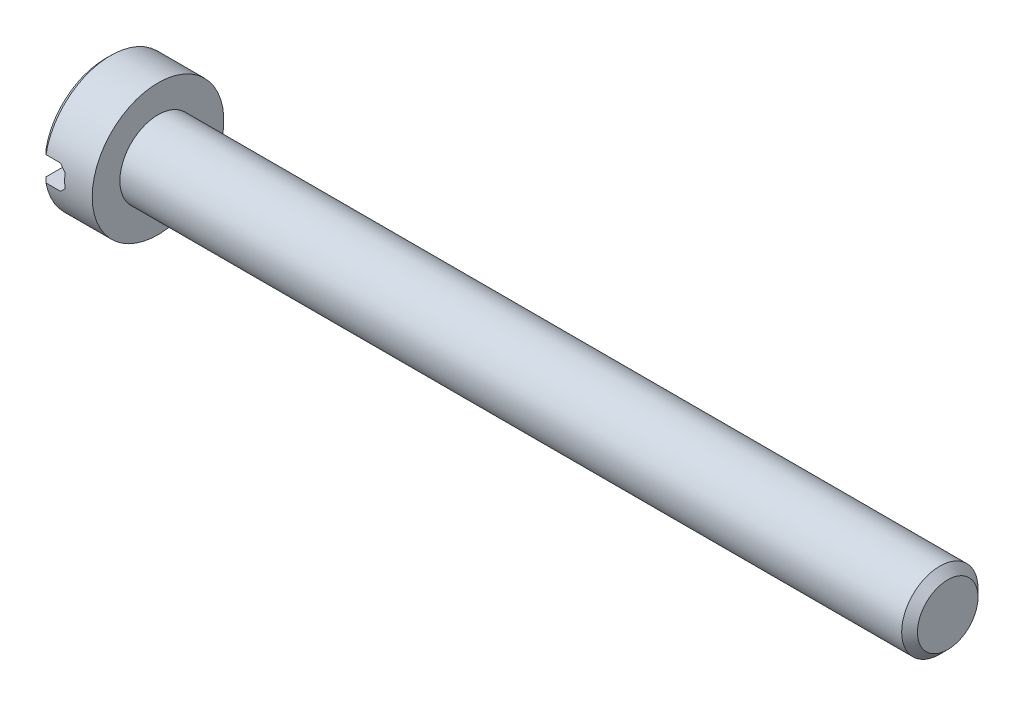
from build123d import *

# Parameters (mm, degrees)
ENL_V_MAT_EXTRU_1_DEPTH = 5
ESQUISSE3_R             = 1.45
EXTRUSION1_DEPTH        = 30
CHANFREIN1_SIZE         = 0.3


with BuildPart() as part:
    # Esquisse1 → R_volution1 (revolve)
    with BuildSketch(Plane.XY, mode=Mode.PRIVATE) as r_volution1_sk:
        Polygon((0, 0), (0, 2.3), (0.2, 2.5), (2, 2.5), (2, 0), align=None)
    revolve(r_volution1_sk.sketch.rotate(Axis((0, 0, 0), (1, 0, 0)), 90), axis=Axis((0, 0, 0), (1, 0, 0)))

    # Esquisse2 → Enl_v. mat.-Extru.1 (cut, symmetric)
    with BuildSketch(Plane.XY):
        Polygon((0, 0.465549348), (0.753445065, 0.465549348), (0.953445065, 0.265549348), (0.953445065, -0.265549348), (0.753445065, -0.465549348), (0, -0.465549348), align=None)
    extrude(amount=ENL_V_MAT_EXTRU_1_DEPTH, both=True, mode=Mode.SUBTRACT)

    # Esquisse3 → Extrusion1 (add)
    with BuildSketch(Plane(origin=(2, 0, 0), x_dir=(0, 0, -1), z_dir=(1, 0, 0))):
        with Locations(Location((0, 0, 0), (0, 0, 180))):
            Circle(ESQUISSE3_R)
    extrude(amount=EXTRUSION1_DEPTH)

    # Chanfrein1
    chanfrein1_edges = [part.edges().sort_by_distance(p)[0] for p in [
        (32, 0, -1.45),
    ]]
    chamfer(chanfrein1_edges, length=CHANFREIN1_SIZE)


solid = part.part
